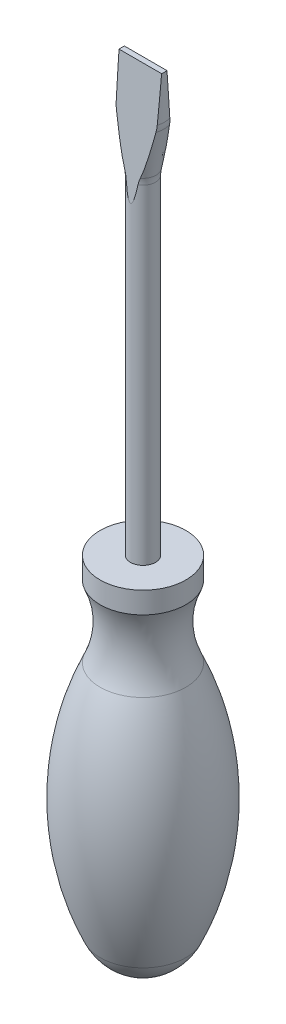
ISO-10303-21;
HEADER;
FILE_DESCRIPTION(('STEP AP214'),'2;1');
FILE_NAME('part.step','',(''),(''),'','','');
FILE_SCHEMA(('AUTOMOTIVE_DESIGN { 1 0 10303 214 1 1 1 1 }'));
ENDSEC;
DATA;
#1=APPLICATION_CONTEXT('core data for automotive mechanical design processes');
#2=APPLICATION_PROTOCOL_DEFINITION('international standard','automotive_design',2000,#1);
#3=PRODUCT_CONTEXT('',#1,'mechanical');
#4=PRODUCT('Part','Part','',(#3));
#5=PRODUCT_RELATED_PRODUCT_CATEGORY('part','',(#4));
#6=PRODUCT_DEFINITION_FORMATION('','',#4);
#7=PRODUCT_DEFINITION_CONTEXT('part definition',#1,'design');
#8=PRODUCT_DEFINITION('design','',#6,#7);
#9=PRODUCT_DEFINITION_SHAPE('','',#8);
#10=(LENGTH_UNIT() NAMED_UNIT(*) SI_UNIT(.MILLI.,.METRE.));
#11=(NAMED_UNIT(*) PLANE_ANGLE_UNIT() SI_UNIT($,.RADIAN.));
#12=(NAMED_UNIT(*) SI_UNIT($,.STERADIAN.) SOLID_ANGLE_UNIT());
#13=UNCERTAINTY_MEASURE_WITH_UNIT(LENGTH_MEASURE(1.E-05),#10,'distance_accuracy_value','');
#14=(GEOMETRIC_REPRESENTATION_CONTEXT(3) GLOBAL_UNCERTAINTY_ASSIGNED_CONTEXT((#13)) GLOBAL_UNIT_ASSIGNED_CONTEXT((#10,
#11,#12)) REPRESENTATION_CONTEXT('',''));
#15=CARTESIAN_POINT('',(0.,0.,0.));
#16=DIRECTION('',(0.,0.,1.));
#17=DIRECTION('',(1.,0.,0.));
#18=AXIS2_PLACEMENT_3D('',#15,#16,#17);
#19=CARTESIAN_POINT('',(0.,30.,0.));
#20=DIRECTION('',(0.,-1.,0.));
#21=DIRECTION('',(0.,0.,-1.));
#22=AXIS2_PLACEMENT_3D('',#19,#20,#21);
#23=CYLINDRICAL_SURFACE('',#22,3.50000000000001);
#24=CARTESIAN_POINT('',(0.,229.,0.));
#25=DIRECTION('',(0.,-0.08304547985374,0.99654575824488));
#26=DIRECTION('',(0.,-0.99654575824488,-0.08304547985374));
#27=AXIS2_PLACEMENT_3D('',#24,#25,#26);
#28=ELLIPSE('',#27,42.1455810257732,3.50000000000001);
#29=CARTESIAN_POINT('',(1.67380559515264,192.114149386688,-3.07382088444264));
#30=VERTEX_POINT('',#29);
#31=CARTESIAN_POINT('',(-1.67380559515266,192.114149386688,-3.07382088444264));
#32=VERTEX_POINT('',#31);
#33=EDGE_CURVE('E451',#30,#32,#28,.F.);
#34=ORIENTED_EDGE('',*,*,#33,.F.);
#35=CARTESIAN_POINT('',(0.,192.114149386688,0.));
#36=DIRECTION('',(0.,-1.,0.));
#37=DIRECTION('',(0.,0.,-1.));
#38=AXIS2_PLACEMENT_3D('',#35,#36,#37);
#39=CIRCLE('',#38,3.5);
#40=CARTESIAN_POINT('',(1.67380559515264,192.114149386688,3.07382088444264));
#41=VERTEX_POINT('',#40);
#42=EDGE_CURVE('E242',#30,#41,#39,.T.);
#43=ORIENTED_EDGE('',*,*,#42,.T.);
#44=CARTESIAN_POINT('',(0.,229.,0.));
#45=DIRECTION('',(0.,0.08304547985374,0.99654575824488));
#46=DIRECTION('',(0.,-0.99654575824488,0.08304547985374));
#47=AXIS2_PLACEMENT_3D('',#44,#45,#46);
#48=ELLIPSE('',#47,42.1455810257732,3.50000000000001);
#49=CARTESIAN_POINT('',(-1.67380559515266,192.114149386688,3.07382088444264));
#50=VERTEX_POINT('',#49);
#51=EDGE_CURVE('E480',#41,#50,#48,.F.);
#52=ORIENTED_EDGE('',*,*,#51,.T.);
#53=EDGE_CURVE('E241',#50,#32,#39,.T.);
#54=ORIENTED_EDGE('',*,*,#53,.T.);
#55=EDGE_LOOP('',(#34,#43,#52,#54));
#56=FACE_BOUND('',#55,.T.);
#57=CARTESIAN_POINT('',(0.,30.,0.));
#58=DIRECTION('',(0.,-1.,0.));
#59=DIRECTION('',(0.,0.,-1.));
#60=AXIS2_PLACEMENT_3D('',#57,#58,#59);
#61=CIRCLE('',#60,3.50000000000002);
#62=CARTESIAN_POINT('',(0.,30.,-3.50000000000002));
#63=VERTEX_POINT('',#62);
#64=EDGE_CURVE('E245',#63,#63,#61,.T.);
#65=ORIENTED_EDGE('',*,*,#64,.F.);
#66=EDGE_LOOP('',(#65));
#67=FACE_BOUND('',#66,.T.);
#68=CARTESIAN_POINT('',(0.,80.,0.));
#69=DIRECTION('',(0.,-1.,0.));
#70=DIRECTION('',(0.,0.,-1.));
#71=AXIS2_PLACEMENT_3D('',#68,#69,#70);
#72=CIRCLE('',#71,3.50000000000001);
#73=CARTESIAN_POINT('',(-3.16227766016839,80.,-1.5));
#74=VERTEX_POINT('',#73);
#75=CARTESIAN_POINT('',(-3.50000000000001,80.,0.));
#76=VERTEX_POINT('',#75);
#77=EDGE_CURVE('E255',#74,#76,#72,.F.);
#78=ORIENTED_EDGE('',*,*,#77,.T.);
#79=CARTESIAN_POINT('',(-3.16227766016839,80.,1.5));
#80=VERTEX_POINT('',#79);
#81=EDGE_CURVE('E259',#76,#80,#72,.F.);
#82=ORIENTED_EDGE('',*,*,#81,.T.);
#83=DIRECTION('',(0.,-1.,0.));
#84=VECTOR('',#83,1.);
#85=CARTESIAN_POINT('',(-3.16227766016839,30.,1.5));
#86=LINE('',#85,#84);
#87=CARTESIAN_POINT('',(-3.16227766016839,60.,1.5));
#88=VERTEX_POINT('',#87);
#89=EDGE_CURVE('E257',#80,#88,#86,.T.);
#90=ORIENTED_EDGE('',*,*,#89,.T.);
#91=CARTESIAN_POINT('',(0.,60.,0.));
#92=DIRECTION('',(0.,1.,0.));
#93=DIRECTION('',(0.,0.,1.));
#94=AXIS2_PLACEMENT_3D('',#91,#92,#93);
#95=CIRCLE('',#94,3.50000000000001);
#96=CARTESIAN_POINT('',(-3.50000000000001,60.,0.));
#97=VERTEX_POINT('',#96);
#98=EDGE_CURVE('E253',#88,#97,#95,.F.);
#99=ORIENTED_EDGE('',*,*,#98,.T.);
#100=CARTESIAN_POINT('',(-3.16227766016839,60.,-1.5));
#101=VERTEX_POINT('',#100);
#102=EDGE_CURVE('E251',#97,#101,#95,.F.);
#103=ORIENTED_EDGE('',*,*,#102,.T.);
#104=DIRECTION('',(0.,-1.,0.));
#105=VECTOR('',#104,1.);
#106=CARTESIAN_POINT('',(-3.16227766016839,30.,-1.5));
#107=LINE('',#106,#105);
#108=EDGE_CURVE('E248',#74,#101,#107,.T.);
#109=ORIENTED_EDGE('',*,*,#108,.F.);
#110=EDGE_LOOP('',(#78,#82,#90,#99,#103,#109));
#111=FACE_BOUND('',#110,.T.);
#112=CARTESIAN_POINT('',(3.16227766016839,60.,-1.5));
#113=VERTEX_POINT('',#112);
#114=CARTESIAN_POINT('',(3.50000000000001,60.,0.));
#115=VERTEX_POINT('',#114);
#116=EDGE_CURVE('E264',#113,#115,#95,.F.);
#117=ORIENTED_EDGE('',*,*,#116,.T.);
#118=CARTESIAN_POINT('',(3.16227766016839,60.,1.5));
#119=VERTEX_POINT('',#118);
#120=EDGE_CURVE('E254',#115,#119,#95,.F.);
#121=ORIENTED_EDGE('',*,*,#120,.T.);
#122=DIRECTION('',(0.,-1.,0.));
#123=VECTOR('',#122,1.);
#124=CARTESIAN_POINT('',(3.16227766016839,30.,1.5));
#125=LINE('',#124,#123);
#126=CARTESIAN_POINT('',(3.16227766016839,80.,1.5));
#127=VERTEX_POINT('',#126);
#128=EDGE_CURVE('E265',#119,#127,#125,.F.);
#129=ORIENTED_EDGE('',*,*,#128,.T.);
#130=CARTESIAN_POINT('',(3.50000000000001,80.,0.));
#131=VERTEX_POINT('',#130);
#132=EDGE_CURVE('E258',#127,#131,#72,.F.);
#133=ORIENTED_EDGE('',*,*,#132,.T.);
#134=CARTESIAN_POINT('',(3.16227766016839,80.,-1.5));
#135=VERTEX_POINT('',#134);
#136=EDGE_CURVE('E271',#131,#135,#72,.F.);
#137=ORIENTED_EDGE('',*,*,#136,.T.);
#138=DIRECTION('',(0.,-1.,0.));
#139=VECTOR('',#138,1.);
#140=CARTESIAN_POINT('',(3.16227766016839,30.,-1.5));
#141=LINE('',#140,#139);
#142=EDGE_CURVE('E261',#113,#135,#141,.F.);
#143=ORIENTED_EDGE('',*,*,#142,.F.);
#144=EDGE_LOOP('',(#117,#121,#129,#133,#137,#143));
#145=FACE_BOUND('',#144,.T.);
#146=ADVANCED_FACE('F45',(#56,#67,#111,#145),#23,.T.);
#147=CARTESIAN_POINT('',(0.,220.,0.));
#148=DIRECTION('',(0.,1.,0.));
#149=DIRECTION('',(0.,0.,1.));
#150=AXIS2_PLACEMENT_3D('',#147,#148,#149);
#151=PLANE('',#150);
#152=DIRECTION('',(1.,0.,0.));
#153=VECTOR('',#152,1.);
#154=CARTESIAN_POINT('',(-10.,220.,-0.750000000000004));
#155=LINE('',#154,#153);
#156=CARTESIAN_POINT('',(-5.95294044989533,220.,-0.750000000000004));
#157=VERTEX_POINT('',#156);
#158=CARTESIAN_POINT('',(5.95294044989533,220.,-0.750000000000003));
#159=VERTEX_POINT('',#158);
#160=EDGE_CURVE('E67',#157,#159,#155,.T.);
#161=ORIENTED_EDGE('',*,*,#160,.F.);
#162=CARTESIAN_POINT('',(0.,220.,0.));
#163=DIRECTION('',(0.,-1.,0.));
#164=DIRECTION('',(0.,0.,-1.));
#165=AXIS2_PLACEMENT_3D('',#162,#163,#164);
#166=CIRCLE('',#165,6.);
#167=CARTESIAN_POINT('',(-5.95294044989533,220.,0.75));
#168=VERTEX_POINT('',#167);
#169=EDGE_CURVE('E219',#168,#157,#166,.T.);
#170=ORIENTED_EDGE('',*,*,#169,.F.);
#171=DIRECTION('',(1.,0.,0.));
#172=VECTOR('',#171,1.);
#173=CARTESIAN_POINT('',(-10.,220.,0.75));
#174=LINE('',#173,#172);
#175=CARTESIAN_POINT('',(5.95294044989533,220.,0.75));
#176=VERTEX_POINT('',#175);
#177=EDGE_CURVE('E203',#168,#176,#174,.T.);
#178=ORIENTED_EDGE('',*,*,#177,.T.);
#179=EDGE_CURVE('E222',#159,#176,#166,.T.);
#180=ORIENTED_EDGE('',*,*,#179,.F.);
#181=EDGE_LOOP('',(#161,#170,#178,#180));
#182=FACE_BOUND('',#181,.T.);
#183=ADVANCED_FACE('F47',(#182),#151,.T.);
#184=CARTESIAN_POINT('',(0.,192.114149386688,0.));
#185=DIRECTION('',(0.,-1.,0.));
#186=DIRECTION('',(0.,0.,-1.));
#187=AXIS2_PLACEMENT_3D('',#184,#185,#186);
#188=TOROIDAL_SURFACE('',#187,13.5,10.);
#189=CARTESIAN_POINT('',(2.18984593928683,193.872255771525,-2.92731201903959));
#190=CARTESIAN_POINT('',(2.1318202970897,193.730376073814,-2.93913532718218));
#191=CARTESIAN_POINT('',(2.07647996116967,193.587339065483,-2.95105507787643));
#192=CARTESIAN_POINT('',(1.97285246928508,193.299310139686,-2.9750574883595));
#193=CARTESIAN_POINT('',(1.92454200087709,193.154326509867,-2.98713945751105));
#194=CARTESIAN_POINT('',(1.83622992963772,192.861760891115,-3.01151992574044));
#195=CARTESIAN_POINT('',(1.79623067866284,192.71417817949,-3.02381848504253));
#196=CARTESIAN_POINT('',(1.72659898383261,192.416097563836,-3.048658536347));
#197=CARTESIAN_POINT('',(1.69700236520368,192.26559143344,-3.06120071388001));
#198=CARTESIAN_POINT('',(1.67377499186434,192.113949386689,-3.07383755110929));
#199=B_SPLINE_CURVE_WITH_KNOTS('',3,(#189,#190,#191,#192,#193,#194,#195,#196,#197,#198),
.UNSPECIFIED.,.F.,.F.,(4,2,2,2,4),(0.,0.461285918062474,0.92100544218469,1.38085487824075,
1.84227280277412),.UNSPECIFIED.);
#200=CARTESIAN_POINT('',(2.18976403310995,193.872055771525,-2.92732868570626));
#201=VERTEX_POINT('',#200);
#202=EDGE_CURVE('E439',#201,#30,#199,.T.);
#203=ORIENTED_EDGE('',*,*,#202,.F.);
#204=CARTESIAN_POINT('',(0.,193.872055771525,0.));
#205=DIRECTION('',(0.,-1.,0.));
#206=DIRECTION('',(0.,0.,-1.));
#207=AXIS2_PLACEMENT_3D('',#204,#205,#206);
#208=CIRCLE('',#207,3.65572424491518);
#209=CARTESIAN_POINT('',(2.18976403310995,193.872055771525,2.92732868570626));
#210=VERTEX_POINT('',#209);
#211=EDGE_CURVE('E238',#201,#210,#208,.T.);
#212=ORIENTED_EDGE('',*,*,#211,.T.);
#213=CARTESIAN_POINT('',(2.18984593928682,193.872255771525,2.92731201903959));
#214=CARTESIAN_POINT('',(2.1318202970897,193.730376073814,2.93913532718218));
#215=CARTESIAN_POINT('',(2.07647996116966,193.587339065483,2.95105507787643));
#216=CARTESIAN_POINT('',(1.97285246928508,193.299310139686,2.9750574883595));
#217=CARTESIAN_POINT('',(1.92454200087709,193.154326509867,2.98713945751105));
#218=CARTESIAN_POINT('',(1.83622992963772,192.861760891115,3.01151992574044));
#219=CARTESIAN_POINT('',(1.79623067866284,192.71417817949,3.02381848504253));
#220=CARTESIAN_POINT('',(1.72659898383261,192.416097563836,3.048658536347));
#221=CARTESIAN_POINT('',(1.69700236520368,192.26559143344,3.06120071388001));
#222=CARTESIAN_POINT('',(1.67377499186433,192.113949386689,3.07383755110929));
#223=B_SPLINE_CURVE_WITH_KNOTS('',3,(#213,#214,#215,#216,#217,#218,#219,#220,#221,#222),
.UNSPECIFIED.,.F.,.F.,(4,2,2,2,4),(0.,0.461285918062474,0.92100544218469,1.38085487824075,
1.84227280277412),.UNSPECIFIED.);
#224=EDGE_CURVE('E463',#210,#41,#223,.T.);
#225=ORIENTED_EDGE('',*,*,#224,.T.);
#226=ORIENTED_EDGE('',*,*,#42,.F.);
#227=EDGE_LOOP('',(#203,#212,#225,#226));
#228=FACE_BOUND('',#227,.T.);
#229=ADVANCED_FACE('F452',(#228),#188,.F.);
#230=CARTESIAN_POINT('',(-1.6737749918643,192.113949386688,-3.0738375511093));
#231=CARTESIAN_POINT('',(-1.69700236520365,192.26559143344,-3.06120071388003));
#232=CARTESIAN_POINT('',(-1.72659898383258,192.416097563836,-3.04865853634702));
#233=CARTESIAN_POINT('',(-1.79623067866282,192.71417817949,-3.02381848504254));
#234=CARTESIAN_POINT('',(-1.8362299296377,192.861760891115,-3.01151992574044));
#235=CARTESIAN_POINT('',(-1.92454200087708,193.154326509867,-2.98713945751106));
#236=CARTESIAN_POINT('',(-1.97285246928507,193.299310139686,-2.9750574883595));
#237=CARTESIAN_POINT('',(-2.07647996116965,193.587339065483,-2.95105507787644));
#238=CARTESIAN_POINT('',(-2.13182029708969,193.730376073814,-2.93913532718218));
#239=CARTESIAN_POINT('',(-2.18984593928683,193.872255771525,-2.92731201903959));
#240=B_SPLINE_CURVE_WITH_KNOTS('',3,(#230,#231,#232,#233,#234,#235,#236,#237,#238,#239),
.UNSPECIFIED.,.F.,.F.,(4,2,2,2,4),(0.,0.461417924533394,0.921267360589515,1.38098688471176,
1.84227280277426),.UNSPECIFIED.);
#241=CARTESIAN_POINT('',(-2.18976403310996,193.872055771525,-2.92732868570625));
#242=VERTEX_POINT('',#241);
#243=EDGE_CURVE('E446',#32,#242,#240,.T.);
#244=ORIENTED_EDGE('',*,*,#243,.F.);
#245=ORIENTED_EDGE('',*,*,#53,.F.);
#246=CARTESIAN_POINT('',(-1.67377499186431,192.113949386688,3.0738375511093));
#247=CARTESIAN_POINT('',(-1.69700236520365,192.26559143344,3.06120071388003));
#248=CARTESIAN_POINT('',(-1.72659898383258,192.416097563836,3.04865853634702));
#249=CARTESIAN_POINT('',(-1.79623067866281,192.71417817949,3.02381848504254));
#250=CARTESIAN_POINT('',(-1.83622992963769,192.861760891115,3.01151992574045));
#251=CARTESIAN_POINT('',(-1.92454200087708,193.154326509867,2.98713945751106));
#252=CARTESIAN_POINT('',(-1.97285246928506,193.299310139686,2.9750574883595));
#253=CARTESIAN_POINT('',(-2.07647996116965,193.587339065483,2.95105507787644));
#254=CARTESIAN_POINT('',(-2.1318202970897,193.730376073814,2.93913532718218));
#255=CARTESIAN_POINT('',(-2.18984593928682,193.872255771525,2.92731201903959));
#256=B_SPLINE_CURVE_WITH_KNOTS('',3,(#246,#247,#248,#249,#250,#251,#252,#253,#254,#255),
.UNSPECIFIED.,.F.,.F.,(4,2,2,2,4),(0.,0.461417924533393,0.921267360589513,1.38098688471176,
1.84227280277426),.UNSPECIFIED.);
#257=CARTESIAN_POINT('',(-2.18976403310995,193.872055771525,2.92732868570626));
#258=VERTEX_POINT('',#257);
#259=EDGE_CURVE('E472',#50,#258,#256,.T.);
#260=ORIENTED_EDGE('',*,*,#259,.T.);
#261=EDGE_CURVE('E237',#258,#242,#208,.T.);
#262=ORIENTED_EDGE('',*,*,#261,.T.);
#263=EDGE_LOOP('',(#244,#245,#260,#262));
#264=FACE_BOUND('',#263,.T.);
#265=ADVANCED_FACE('F456',(#264),#188,.F.);
#266=CARTESIAN_POINT('',(0.,193.872055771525,0.));
#267=DIRECTION('',(0.,1.,0.));
#268=DIRECTION('',(0.,0.,1.));
#269=AXIS2_PLACEMENT_3D('',#266,#267,#268);
#270=CONICAL_SURFACE('',#269,3.65572424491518,0.176708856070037);
#271=CARTESIAN_POINT('',(5.52477930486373,206.128144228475,-1.90598798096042));
#272=CARTESIAN_POINT('',(5.43678863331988,205.723928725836,-1.93967260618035));
#273=CARTESIAN_POINT('',(5.34787259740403,205.319911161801,-1.97334073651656));
#274=CARTESIAN_POINT('',(5.16783715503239,204.512354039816,-2.04063716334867));
#275=CARTESIAN_POINT('',(5.07671769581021,204.108814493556,-2.07426545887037));
#276=CARTESIAN_POINT('',(4.89185553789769,203.302003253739,-2.14149972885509));
#277=CARTESIAN_POINT('',(4.79811086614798,202.898732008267,-2.17510566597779));
#278=CARTESIAN_POINT('',(4.60759624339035,202.092901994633,-2.24225816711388));
#279=CARTESIAN_POINT('',(4.51082631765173,201.690343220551,-2.27580473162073));
#280=CARTESIAN_POINT('',(4.31400742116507,200.887545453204,-2.34270454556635));
#281=CARTESIAN_POINT('',(4.21397141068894,200.487303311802,-2.37605805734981));
#282=CARTESIAN_POINT('',(4.00949441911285,199.6879380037,-2.44267183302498));
#283=CARTESIAN_POINT('',(3.90505348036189,199.288814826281,-2.4759320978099));
#284=CARTESIAN_POINT('',(3.69068745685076,198.492148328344,-2.54232097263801));
#285=CARTESIAN_POINT('',(3.58076390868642,198.094604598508,-2.57544961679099));
#286=CARTESIAN_POINT('',(3.35383271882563,197.301525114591,-2.6415395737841));
#287=CARTESIAN_POINT('',(3.23682530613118,196.905989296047,-2.67450089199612));
#288=CARTESIAN_POINT('',(3.04622907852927,196.289242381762,-2.72589646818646));
#289=CARTESIAN_POINT('',(2.97589030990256,196.06703485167,-2.7444137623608));
#290=CARTESIAN_POINT('',(2.8315026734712,195.623823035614,-2.78134808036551));
#291=CARTESIAN_POINT('',(2.75745391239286,195.402818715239,-2.79976510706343));
#292=CARTESIAN_POINT('',(2.60470377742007,194.962177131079,-2.83648523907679));
#293=CARTESIAN_POINT('',(2.52599826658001,194.742541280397,-2.85478822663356));
#294=CARTESIAN_POINT('',(2.40353638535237,194.414687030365,-2.88210941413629));
#295=CARTESIAN_POINT('',(2.36197581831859,194.305654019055,-2.89119549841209));
#296=CARTESIAN_POINT('',(2.27715808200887,194.088237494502,-2.90931354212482));
#297=CARTESIAN_POINT('',(2.23390079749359,193.979854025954,-2.91834549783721));
#298=CARTESIAN_POINT('',(2.18968212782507,193.871855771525,-2.92734535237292));
#299=B_SPLINE_CURVE_WITH_KNOTS('',3,(#271,#272,#273,#274,#275,#276,#277,#278,#279,#280,#281,
#282,#283,#284,#285,#286,#287,#288,#289,#290,#291,#292,#293,#294,#295,#296,#297,#298),
.UNSPECIFIED.,.F.,.F.,(4,2,2,2,2,2,2,2,2,2,2,2,2,4),(0.,1.24515446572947,2.49033877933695,
3.73648549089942,4.98262179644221,6.22430288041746,7.46597202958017,8.70729511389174,
9.94857809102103,10.6499793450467,11.3513604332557,12.0533742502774,12.4044775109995,
12.7556046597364),.UNSPECIFIED.);
#300=CARTESIAN_POINT('',(5.5247357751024,206.127944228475,-1.90600464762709));
#301=VERTEX_POINT('',#300);
#302=EDGE_CURVE('E432',#301,#201,#299,.T.);
#303=ORIENTED_EDGE('',*,*,#302,.F.);
#304=CARTESIAN_POINT('',(0.,206.127944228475,0.));
#305=DIRECTION('',(0.,-1.,0.));
#306=DIRECTION('',(0.,0.,-1.));
#307=AXIS2_PLACEMENT_3D('',#304,#305,#306);
#308=CIRCLE('',#307,5.84427575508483);
#309=CARTESIAN_POINT('',(5.5247357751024,206.127944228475,1.90600464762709));
#310=VERTEX_POINT('',#309);
#311=EDGE_CURVE('E234',#301,#310,#308,.T.);
#312=ORIENTED_EDGE('',*,*,#311,.T.);
#313=CARTESIAN_POINT('',(5.52477930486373,206.128144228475,1.90598798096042));
#314=CARTESIAN_POINT('',(5.43678863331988,205.723928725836,1.93967260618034));
#315=CARTESIAN_POINT('',(5.34787259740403,205.319911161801,1.97334073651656));
#316=CARTESIAN_POINT('',(5.16783715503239,204.512354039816,2.04063716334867));
#317=CARTESIAN_POINT('',(5.07671769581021,204.108814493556,2.07426545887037));
#318=CARTESIAN_POINT('',(4.89185553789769,203.302003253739,2.14149972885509));
#319=CARTESIAN_POINT('',(4.79811086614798,202.898732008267,2.17510566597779));
#320=CARTESIAN_POINT('',(4.60759624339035,202.092901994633,2.24225816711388));
#321=CARTESIAN_POINT('',(4.51082631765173,201.690343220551,2.27580473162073));
#322=CARTESIAN_POINT('',(4.31400742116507,200.887545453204,2.34270454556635));
#323=CARTESIAN_POINT('',(4.21397141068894,200.487303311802,2.37605805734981));
#324=CARTESIAN_POINT('',(4.00949441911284,199.6879380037,2.44267183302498));
#325=CARTESIAN_POINT('',(3.90505348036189,199.288814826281,2.4759320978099));
#326=CARTESIAN_POINT('',(3.69068745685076,198.492148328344,2.542320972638));
#327=CARTESIAN_POINT('',(3.58076390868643,198.094604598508,2.57544961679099));
#328=CARTESIAN_POINT('',(3.35383271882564,197.301525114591,2.6415395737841));
#329=CARTESIAN_POINT('',(3.23682530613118,196.905989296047,2.67450089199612));
#330=CARTESIAN_POINT('',(3.04622907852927,196.289242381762,2.72589646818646));
#331=CARTESIAN_POINT('',(2.97589030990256,196.06703485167,2.7444137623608));
#332=CARTESIAN_POINT('',(2.8315026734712,195.623823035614,2.78134808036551));
#333=CARTESIAN_POINT('',(2.75745391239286,195.402818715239,2.79976510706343));
#334=CARTESIAN_POINT('',(2.60470377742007,194.962177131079,2.83648523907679));
#335=CARTESIAN_POINT('',(2.52599826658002,194.742541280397,2.85478822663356));
#336=CARTESIAN_POINT('',(2.40353638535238,194.414687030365,2.88210941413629));
#337=CARTESIAN_POINT('',(2.36197581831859,194.305654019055,2.89119549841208));
#338=CARTESIAN_POINT('',(2.27715808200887,194.088237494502,2.90931354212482));
#339=CARTESIAN_POINT('',(2.23390079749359,193.979854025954,2.91834549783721));
#340=CARTESIAN_POINT('',(2.18968212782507,193.871855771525,2.92734535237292));
#341=B_SPLINE_CURVE_WITH_KNOTS('',3,(#313,#314,#315,#316,#317,#318,#319,#320,#321,#322,#323,
#324,#325,#326,#327,#328,#329,#330,#331,#332,#333,#334,#335,#336,#337,#338,#339,#340),
.UNSPECIFIED.,.F.,.F.,(4,2,2,2,2,2,2,2,2,2,2,2,2,4),(0.,1.24515446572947,2.49033877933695,
3.73648549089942,4.98262179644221,6.22430288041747,7.46597202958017,8.70729511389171,
9.94857809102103,10.6499793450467,11.3513604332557,12.0533742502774,12.4044775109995,
12.7556046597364),.UNSPECIFIED.);
#342=EDGE_CURVE('E768',#310,#210,#341,.T.);
#343=ORIENTED_EDGE('',*,*,#342,.T.);
#344=ORIENTED_EDGE('',*,*,#211,.F.);
#345=EDGE_LOOP('',(#303,#312,#343,#344));
#346=FACE_BOUND('',#345,.T.);
#347=ADVANCED_FACE('F458',(#346),#270,.T.);
#348=CARTESIAN_POINT('',(-2.18968212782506,193.871855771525,-2.92734535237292));
#349=CARTESIAN_POINT('',(-2.2389104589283,193.992104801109,-2.91732459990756));
#350=CARTESIAN_POINT('',(-2.28695480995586,194.11282816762,-2.90726431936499));
#351=CARTESIAN_POINT('',(-2.38097166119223,194.355063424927,-2.88707804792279));
#352=CARTESIAN_POINT('',(-2.42694432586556,194.47657525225,-2.87695206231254));
#353=CARTESIAN_POINT('',(-2.51710834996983,194.720210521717,-2.85664912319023));
#354=CARTESIAN_POINT('',(-2.5613002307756,194.842333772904,-2.84647218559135));
#355=CARTESIAN_POINT('',(-2.6481386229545,195.087126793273,-2.82607276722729));
#356=CARTESIAN_POINT('',(-2.69078509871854,195.209796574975,-2.81585028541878));
#357=CARTESIAN_POINT('',(-2.81662593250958,195.578298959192,-2.78514175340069));
#358=CARTESIAN_POINT('',(-2.89779317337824,195.824819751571,-2.76459835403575));
#359=CARTESIAN_POINT('',(-3.0558436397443,196.319236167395,-2.72339698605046));
#360=CARTESIAN_POINT('',(-3.13272648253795,196.567131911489,-2.70273900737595));
#361=CARTESIAN_POINT('',(-3.28288539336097,197.063629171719,-2.66136423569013));
#362=CARTESIAN_POINT('',(-3.35616630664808,197.312229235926,-2.64064756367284));
#363=CARTESIAN_POINT('',(-3.49981367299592,197.810252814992,-2.59914559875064));
#364=CARTESIAN_POINT('',(-3.57018021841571,198.059676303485,-2.57836030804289));
#365=CARTESIAN_POINT('',(-3.77763910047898,198.809071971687,-2.51591066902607));
#366=CARTESIAN_POINT('',(-3.91105650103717,199.310054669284,-2.474162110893));
#367=CARTESIAN_POINT('',(-4.17612587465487,200.335162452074,-2.38873646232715));
#368=CARTESIAN_POINT('',(-4.30746287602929,200.859367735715,-2.3450526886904));
#369=CARTESIAN_POINT('',(-4.56404600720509,201.909200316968,-2.25756664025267));
#370=CARTESIAN_POINT('',(-4.68929270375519,202.43482747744,-2.21376437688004));
#371=CARTESIAN_POINT('',(-4.93514910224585,203.487890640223,-2.12600911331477));
#372=CARTESIAN_POINT('',(-5.055752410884,204.015328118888,-2.08205599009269));
#373=CARTESIAN_POINT('',(-5.29301258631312,205.071115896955,-1.99407367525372));
#374=CARTESIAN_POINT('',(-5.40966923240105,205.599466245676,-1.95004447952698));
#375=CARTESIAN_POINT('',(-5.52477930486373,206.128144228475,-1.90598798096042));
#376=B_SPLINE_CURVE_WITH_KNOTS('',3,(#348,#349,#350,#351,#352,#353,#354,#355,#356,#357,#358,
#359,#360,#361,#362,#363,#364,#365,#366,#367,#368,#369,#370,#371,#372,#373,#374,#375),
.UNSPECIFIED.,.F.,.F.,(4,2,2,2,2,2,2,2,2,2,2,2,2,4),(0.,0.39094853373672,0.781865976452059,
1.17266812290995,1.5634792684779,2.34447631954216,3.12554302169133,3.90552855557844,
4.68548935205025,6.24577102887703,7.87224026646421,9.49855785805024,11.1270399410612,
12.7556129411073),.UNSPECIFIED.);
#377=CARTESIAN_POINT('',(-5.5247357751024,206.127944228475,-1.90600464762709));
#378=VERTEX_POINT('',#377);
#379=EDGE_CURVE('E404',#242,#378,#376,.T.);
#380=ORIENTED_EDGE('',*,*,#379,.F.);
#381=ORIENTED_EDGE('',*,*,#261,.F.);
#382=CARTESIAN_POINT('',(-2.18968212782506,193.871855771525,2.92734535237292));
#383=CARTESIAN_POINT('',(-2.2389104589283,193.992104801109,2.91732459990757));
#384=CARTESIAN_POINT('',(-2.28695480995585,194.11282816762,2.90726431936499));
#385=CARTESIAN_POINT('',(-2.38097166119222,194.355063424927,2.88707804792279));
#386=CARTESIAN_POINT('',(-2.42694432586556,194.47657525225,2.87695206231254));
#387=CARTESIAN_POINT('',(-2.51710834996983,194.720210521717,2.85664912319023));
#388=CARTESIAN_POINT('',(-2.5613002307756,194.842333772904,2.84647218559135));
#389=CARTESIAN_POINT('',(-2.6481386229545,195.087126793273,2.82607276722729));
#390=CARTESIAN_POINT('',(-2.69078509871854,195.209796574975,2.81585028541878));
#391=CARTESIAN_POINT('',(-2.81662593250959,195.578298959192,2.78514175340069));
#392=CARTESIAN_POINT('',(-2.89779317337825,195.824819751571,2.76459835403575));
#393=CARTESIAN_POINT('',(-3.05584363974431,196.319236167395,2.72339698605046));
#394=CARTESIAN_POINT('',(-3.13272648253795,196.567131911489,2.70273900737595));
#395=CARTESIAN_POINT('',(-3.28288539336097,197.063629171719,2.66136423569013));
#396=CARTESIAN_POINT('',(-3.35616630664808,197.312229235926,2.64064756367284));
#397=CARTESIAN_POINT('',(-3.49981367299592,197.810252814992,2.59914559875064));
#398=CARTESIAN_POINT('',(-3.57018021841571,198.059676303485,2.57836030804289));
#399=CARTESIAN_POINT('',(-3.77763910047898,198.809071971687,2.51591066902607));
#400=CARTESIAN_POINT('',(-3.91105650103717,199.310054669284,2.474162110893));
#401=CARTESIAN_POINT('',(-4.17612587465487,200.335162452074,2.38873646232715));
#402=CARTESIAN_POINT('',(-4.30746287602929,200.859367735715,2.34505268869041));
#403=CARTESIAN_POINT('',(-4.56404600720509,201.909200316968,2.25756664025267));
#404=CARTESIAN_POINT('',(-4.68929270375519,202.43482747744,2.21376437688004));
#405=CARTESIAN_POINT('',(-4.93514910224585,203.487890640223,2.12600911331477));
#406=CARTESIAN_POINT('',(-5.055752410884,204.015328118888,2.08205599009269));
#407=CARTESIAN_POINT('',(-5.29301258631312,205.071115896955,1.99407367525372));
#408=CARTESIAN_POINT('',(-5.40966923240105,205.599466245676,1.95004447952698));
#409=CARTESIAN_POINT('',(-5.52477930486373,206.128144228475,1.90598798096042));
#410=B_SPLINE_CURVE_WITH_KNOTS('',3,(#382,#383,#384,#385,#386,#387,#388,#389,#390,#391,#392,
#393,#394,#395,#396,#397,#398,#399,#400,#401,#402,#403,#404,#405,#406,#407,#408,#409),
.UNSPECIFIED.,.F.,.F.,(4,2,2,2,2,2,2,2,2,2,2,2,2,4),(0.,0.39094853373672,0.78186597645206,
1.17266812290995,1.5634792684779,2.34447631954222,3.12554302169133,3.90552855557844,
4.68548935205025,6.24577102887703,7.87224026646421,9.49855785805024,11.1270399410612,
12.7556129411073),.UNSPECIFIED.);
#411=CARTESIAN_POINT('',(-5.5247357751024,206.127944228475,1.90600464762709));
#412=VERTEX_POINT('',#411);
#413=EDGE_CURVE('E479',#258,#412,#410,.T.);
#414=ORIENTED_EDGE('',*,*,#413,.T.);
#415=EDGE_CURVE('E233',#412,#378,#308,.T.);
#416=ORIENTED_EDGE('',*,*,#415,.T.);
#417=EDGE_LOOP('',(#380,#381,#414,#416));
#418=FACE_BOUND('',#417,.T.);
#419=ADVANCED_FACE('F510',(#418),#270,.T.);
#420=CARTESIAN_POINT('',(0.,207.885850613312,0.));
#421=DIRECTION('',(0.,-1.,0.));
#422=DIRECTION('',(0.,0.,-1.));
#423=AXIS2_PLACEMENT_3D('',#420,#421,#422);
#424=DEGENERATE_TOROIDAL_SURFACE('',#423,4.,10.,.F.);
#425=CARTESIAN_POINT('',(5.73621604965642,207.886050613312,-1.75949578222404));
#426=CARTESIAN_POINT('',(5.72868223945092,207.590471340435,-1.78412738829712));
#427=CARTESIAN_POINT('',(5.70724503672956,207.295357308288,-1.80872022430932));
#428=CARTESIAN_POINT('',(5.65435603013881,206.85534805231,-1.84538766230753));
#429=CARTESIAN_POINT('',(5.6332838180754,206.70918181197,-1.85756818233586));
#430=CARTESIAN_POINT('',(5.58419851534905,206.417679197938,-1.88186006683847));
#431=CARTESIAN_POINT('',(5.55617017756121,206.27234537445,-1.89397121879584));
#432=CARTESIAN_POINT('',(5.524692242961,206.127744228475,-1.90602131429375));
#433=B_SPLINE_CURVE_WITH_KNOTS('',3,(#425,#426,#427,#428,#429,#430,#431,#432),.UNSPECIFIED.,.F.,
.F.,(4,2,2,4),(0.,0.889500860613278,1.33388400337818,1.77924992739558),.UNSPECIFIED.);
#434=CARTESIAN_POINT('',(5.73621093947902,207.885850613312,-1.75951244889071));
#435=VERTEX_POINT('',#434);
#436=EDGE_CURVE('E423',#435,#301,#433,.T.);
#437=ORIENTED_EDGE('',*,*,#436,.F.);
#438=CARTESIAN_POINT('',(0.,207.885850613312,0.));
#439=DIRECTION('',(0.,-1.,0.));
#440=DIRECTION('',(0.,0.,-1.));
#441=AXIS2_PLACEMENT_3D('',#438,#439,#440);
#442=CIRCLE('',#441,6.00000000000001);
#443=CARTESIAN_POINT('',(5.73621093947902,207.885850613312,1.75951244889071));
#444=VERTEX_POINT('',#443);
#445=EDGE_CURVE('E230',#435,#444,#442,.T.);
#446=ORIENTED_EDGE('',*,*,#445,.T.);
#447=CARTESIAN_POINT('',(5.73621604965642,207.886050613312,1.75949578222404));
#448=CARTESIAN_POINT('',(5.72868223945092,207.590471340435,1.78412738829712));
#449=CARTESIAN_POINT('',(5.70724503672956,207.295357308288,1.80872022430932));
#450=CARTESIAN_POINT('',(5.65435603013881,206.85534805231,1.84538766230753));
#451=CARTESIAN_POINT('',(5.6332838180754,206.70918181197,1.85756818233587));
#452=CARTESIAN_POINT('',(5.58419851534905,206.417679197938,1.88186006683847));
#453=CARTESIAN_POINT('',(5.55617017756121,206.27234537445,1.89397121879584));
#454=CARTESIAN_POINT('',(5.524692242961,206.127744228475,1.90602131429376));
#455=B_SPLINE_CURVE_WITH_KNOTS('',3,(#447,#448,#449,#450,#451,#452,#453,#454),.UNSPECIFIED.,.F.,
.F.,(4,2,2,4),(0.,0.889500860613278,1.33388400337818,1.77924992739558),.UNSPECIFIED.);
#456=EDGE_CURVE('E60',#444,#310,#455,.T.);
#457=ORIENTED_EDGE('',*,*,#456,.T.);
#458=ORIENTED_EDGE('',*,*,#311,.F.);
#459=EDGE_LOOP('',(#437,#446,#457,#458));
#460=FACE_BOUND('',#459,.T.);
#461=ADVANCED_FACE('F411',(#460),#424,.F.);
#462=CARTESIAN_POINT('',(-5.524692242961,206.127744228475,-1.90602131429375));
#463=CARTESIAN_POINT('',(-5.55617017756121,206.27234537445,-1.89397121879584));
#464=CARTESIAN_POINT('',(-5.58419851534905,206.417679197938,-1.88186006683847));
#465=CARTESIAN_POINT('',(-5.6332838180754,206.70918181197,-1.85756818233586));
#466=CARTESIAN_POINT('',(-5.65435603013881,206.85534805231,-1.84538766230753));
#467=CARTESIAN_POINT('',(-5.70724503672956,207.295357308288,-1.80872022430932));
#468=CARTESIAN_POINT('',(-5.72868223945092,207.590471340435,-1.78412738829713));
#469=CARTESIAN_POINT('',(-5.73621604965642,207.886050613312,-1.75949578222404));
#470=B_SPLINE_CURVE_WITH_KNOTS('',3,(#462,#463,#464,#465,#466,#467,#468,#469),.UNSPECIFIED.,.F.,
.F.,(4,2,2,4),(0.,0.445365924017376,0.889749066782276,1.77924992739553),.UNSPECIFIED.);
#471=CARTESIAN_POINT('',(-5.73621093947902,207.885850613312,-1.7595124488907));
#472=VERTEX_POINT('',#471);
#473=EDGE_CURVE('E326',#378,#472,#470,.T.);
#474=ORIENTED_EDGE('',*,*,#473,.F.);
#475=ORIENTED_EDGE('',*,*,#415,.F.);
#476=CARTESIAN_POINT('',(-5.524692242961,206.127744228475,1.90602131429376));
#477=CARTESIAN_POINT('',(-5.55617017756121,206.27234537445,1.89397121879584));
#478=CARTESIAN_POINT('',(-5.58419851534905,206.417679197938,1.88186006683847));
#479=CARTESIAN_POINT('',(-5.6332838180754,206.70918181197,1.85756818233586));
#480=CARTESIAN_POINT('',(-5.65435603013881,206.85534805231,1.84538766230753));
#481=CARTESIAN_POINT('',(-5.70724503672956,207.295357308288,1.80872022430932));
#482=CARTESIAN_POINT('',(-5.72868223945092,207.590471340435,1.78412738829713));
#483=CARTESIAN_POINT('',(-5.73621604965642,207.886050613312,1.75949578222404));
#484=B_SPLINE_CURVE_WITH_KNOTS('',3,(#476,#477,#478,#479,#480,#481,#482,#483),.UNSPECIFIED.,.F.,
.F.,(4,2,2,4),(0.,0.445365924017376,0.889749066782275,1.77924992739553),.UNSPECIFIED.);
#485=CARTESIAN_POINT('',(-5.73621093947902,207.885850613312,1.7595124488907));
#486=VERTEX_POINT('',#485);
#487=EDGE_CURVE('E486',#412,#486,#484,.T.);
#488=ORIENTED_EDGE('',*,*,#487,.T.);
#489=EDGE_CURVE('E221',#486,#472,#442,.T.);
#490=ORIENTED_EDGE('',*,*,#489,.T.);
#491=EDGE_LOOP('',(#474,#475,#488,#490));
#492=FACE_BOUND('',#491,.T.);
#493=ADVANCED_FACE('F513',(#492),#424,.F.);
#494=CARTESIAN_POINT('',(0.,30.,0.));
#495=DIRECTION('',(0.,-1.,0.));
#496=DIRECTION('',(0.,0.,-1.));
#497=AXIS2_PLACEMENT_3D('',#494,#495,#496);
#498=CYLINDRICAL_SURFACE('',#497,6.);
#499=CARTESIAN_POINT('',(0.,229.,0.));
#500=DIRECTION('',(0.,-0.08304547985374,0.99654575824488));
#501=DIRECTION('',(0.,-0.99654575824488,-0.08304547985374));
#502=AXIS2_PLACEMENT_3D('',#499,#500,#501);
#503=ELLIPSE('',#502,72.2495674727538,6.);
#504=EDGE_CURVE('E12',#472,#157,#503,.F.);
#505=ORIENTED_EDGE('',*,*,#504,.F.);
#506=ORIENTED_EDGE('',*,*,#489,.F.);
#507=CARTESIAN_POINT('',(0.,229.,0.));
#508=DIRECTION('',(0.,0.08304547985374,0.99654575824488));
#509=DIRECTION('',(0.,-0.99654575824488,0.08304547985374));
#510=AXIS2_PLACEMENT_3D('',#507,#508,#509);
#511=ELLIPSE('',#510,72.2495674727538,6.);
#512=EDGE_CURVE('E206',#486,#168,#511,.F.);
#513=ORIENTED_EDGE('',*,*,#512,.T.);
#514=ORIENTED_EDGE('',*,*,#169,.T.);
#515=EDGE_LOOP('',(#505,#506,#513,#514));
#516=FACE_BOUND('',#515,.T.);
#517=ADVANCED_FACE('F218',(#516),#498,.T.);
#518=EDGE_CURVE('E49',#159,#435,#503,.F.);
#519=ORIENTED_EDGE('',*,*,#518,.F.);
#520=ORIENTED_EDGE('',*,*,#179,.T.);
#521=EDGE_CURVE('E208',#176,#444,#511,.F.);
#522=ORIENTED_EDGE('',*,*,#521,.T.);
#523=ORIENTED_EDGE('',*,*,#445,.F.);
#524=EDGE_LOOP('',(#519,#520,#522,#523));
#525=FACE_BOUND('',#524,.T.);
#526=ADVANCED_FACE('F519',(#525),#498,.T.);
#527=CARTESIAN_POINT('',(0.,30.,-3.50000000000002));
#528=DIRECTION('',(0.,-1.,0.));
#529=DIRECTION('',(0.,0.,-1.));
#530=AXIS2_PLACEMENT_3D('',#527,#528,#529);
#531=PLANE('',#530);
#532=ORIENTED_EDGE('',*,*,#64,.T.);
#533=EDGE_LOOP('',(#532));
#534=FACE_BOUND('',#533,.T.);
#535=ADVANCED_FACE('F570',(#534),#531,.T.);
#536=CARTESIAN_POINT('',(-3.50000000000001,80.,1.5));
#537=DIRECTION('',(0.780868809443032,-0.624695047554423,0.));
#538=DIRECTION('',(0.624695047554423,0.780868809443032,0.));
#539=AXIS2_PLACEMENT_3D('',#536,#537,#538);
#540=PLANE('',#539);
#541=DIRECTION('',(-0.624695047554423,-0.780868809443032,0.));
#542=VECTOR('',#541,1.);
#543=CARTESIAN_POINT('',(-3.50000000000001,80.,-1.5));
#544=LINE('',#543,#542);
#545=CARTESIAN_POINT('',(-3.50000000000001,80.,-1.5));
#546=VERTEX_POINT('',#545);
#547=CARTESIAN_POINT('',(-7.5,75.,-1.5));
#548=VERTEX_POINT('',#547);
#549=EDGE_CURVE('E316',#546,#548,#544,.T.);
#550=ORIENTED_EDGE('',*,*,#549,.T.);
#551=DIRECTION('',(0.,0.,-1.));
#552=VECTOR('',#551,1.);
#553=CARTESIAN_POINT('',(-7.5,75.,1.5));
#554=LINE('',#553,#552);
#555=CARTESIAN_POINT('',(-7.5,75.,1.5));
#556=VERTEX_POINT('',#555);
#557=EDGE_CURVE('E302',#556,#548,#554,.T.);
#558=ORIENTED_EDGE('',*,*,#557,.F.);
#559=DIRECTION('',(-0.624695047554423,-0.780868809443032,0.));
#560=VECTOR('',#559,1.);
#561=CARTESIAN_POINT('',(-3.50000000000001,80.,1.5));
#562=LINE('',#561,#560);
#563=CARTESIAN_POINT('',(-3.50000000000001,80.,1.5));
#564=VERTEX_POINT('',#563);
#565=EDGE_CURVE('E392',#564,#556,#562,.T.);
#566=ORIENTED_EDGE('',*,*,#565,.F.);
#567=DIRECTION('',(0.,0.,-1.));
#568=VECTOR('',#567,1.);
#569=CARTESIAN_POINT('',(-3.50000000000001,80.,1.5));
#570=LINE('',#569,#568);
#571=EDGE_CURVE('E223',#564,#76,#570,.T.);
#572=ORIENTED_EDGE('',*,*,#571,.T.);
#573=EDGE_CURVE('E226',#76,#546,#570,.T.);
#574=ORIENTED_EDGE('',*,*,#573,.T.);
#575=EDGE_LOOP('',(#550,#558,#566,#572,#574));
#576=FACE_BOUND('',#575,.T.);
#577=ADVANCED_FACE('F314',(#576),#540,.F.);
#578=CARTESIAN_POINT('',(-7.5,75.,1.5));
#579=DIRECTION('',(1.,0.,0.));
#580=DIRECTION('',(0.,0.,-1.));
#581=AXIS2_PLACEMENT_3D('',#578,#579,#580);
#582=PLANE('',#581);
#583=DIRECTION('',(0.,-1.,0.));
#584=VECTOR('',#583,1.);
#585=CARTESIAN_POINT('',(-7.5,75.,-1.5));
#586=LINE('',#585,#584);
#587=CARTESIAN_POINT('',(-7.5,65.,-1.5));
#588=VERTEX_POINT('',#587);
#589=EDGE_CURVE('E329',#548,#588,#586,.T.);
#590=ORIENTED_EDGE('',*,*,#589,.T.);
#591=DIRECTION('',(0.,0.,-1.));
#592=VECTOR('',#591,1.);
#593=CARTESIAN_POINT('',(-7.5,65.,1.5));
#594=LINE('',#593,#592);
#595=CARTESIAN_POINT('',(-7.5,65.,1.5));
#596=VERTEX_POINT('',#595);
#597=EDGE_CURVE('E301',#596,#588,#594,.T.);
#598=ORIENTED_EDGE('',*,*,#597,.F.);
#599=DIRECTION('',(0.,-1.,0.));
#600=VECTOR('',#599,1.);
#601=CARTESIAN_POINT('',(-7.5,75.,1.5));
#602=LINE('',#601,#600);
#603=EDGE_CURVE('E390',#556,#596,#602,.T.);
#604=ORIENTED_EDGE('',*,*,#603,.F.);
#605=ORIENTED_EDGE('',*,*,#557,.T.);
#606=EDGE_LOOP('',(#590,#598,#604,#605));
#607=FACE_BOUND('',#606,.T.);
#608=ADVANCED_FACE('F684',(#607),#582,.F.);
#609=CARTESIAN_POINT('',(0.,0.,1.5));
#610=DIRECTION('',(0.,0.,-1.));
#611=DIRECTION('',(-1.,0.,0.));
#612=AXIS2_PLACEMENT_3D('',#609,#610,#611);
#613=PLANE('',#612);
#614=ORIENTED_EDGE('',*,*,#89,.F.);
#615=DIRECTION('',(-1.,0.,0.));
#616=VECTOR('',#615,1.);
#617=CARTESIAN_POINT('',(-3.50000000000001,80.,1.5));
#618=LINE('',#617,#616);
#619=EDGE_CURVE('E345',#80,#564,#618,.T.);
#620=ORIENTED_EDGE('',*,*,#619,.T.);
#621=ORIENTED_EDGE('',*,*,#565,.T.);
#622=ORIENTED_EDGE('',*,*,#603,.T.);
#623=DIRECTION('',(0.624695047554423,-0.780868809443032,0.));
#624=VECTOR('',#623,1.);
#625=CARTESIAN_POINT('',(-7.5,65.,1.5));
#626=LINE('',#625,#624);
#627=CARTESIAN_POINT('',(-3.50000000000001,60.,1.5));
#628=VERTEX_POINT('',#627);
#629=EDGE_CURVE('E388',#596,#628,#626,.T.);
#630=ORIENTED_EDGE('',*,*,#629,.T.);
#631=DIRECTION('',(1.,0.,0.));
#632=VECTOR('',#631,1.);
#633=CARTESIAN_POINT('',(3.50000000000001,60.,1.5));
#634=LINE('',#633,#632);
#635=EDGE_CURVE('E300',#628,#88,#634,.T.);
#636=ORIENTED_EDGE('',*,*,#635,.T.);
#637=EDGE_LOOP('',(#614,#620,#621,#622,#630,#636));
#638=FACE_BOUND('',#637,.T.);
#639=ADVANCED_FACE('F634',(#638),#613,.F.);
#640=CARTESIAN_POINT('',(3.50000000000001,60.,1.5));
#641=DIRECTION('',(0.,1.,0.));
#642=DIRECTION('',(0.,0.,1.));
#643=AXIS2_PLACEMENT_3D('',#640,#641,#642);
#644=PLANE('',#643);
#645=ORIENTED_EDGE('',*,*,#98,.F.);
#646=ORIENTED_EDGE('',*,*,#635,.F.);
#647=DIRECTION('',(0.,0.,-1.));
#648=VECTOR('',#647,1.);
#649=CARTESIAN_POINT('',(-3.50000000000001,60.,1.5));
#650=LINE('',#649,#648);
#651=EDGE_CURVE('E293',#628,#97,#650,.T.);
#652=ORIENTED_EDGE('',*,*,#651,.T.);
#653=EDGE_LOOP('',(#645,#646,#652));
#654=FACE_BOUND('',#653,.T.);
#655=ADVANCED_FACE('F299',(#654),#644,.F.);
#656=CARTESIAN_POINT('',(-3.50000000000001,80.,1.5));
#657=DIRECTION('',(0.,-1.,0.));
#658=DIRECTION('',(0.,0.,-1.));
#659=AXIS2_PLACEMENT_3D('',#656,#657,#658);
#660=PLANE('',#659);
#661=ORIENTED_EDGE('',*,*,#81,.F.);
#662=ORIENTED_EDGE('',*,*,#571,.F.);
#663=ORIENTED_EDGE('',*,*,#619,.F.);
#664=EDGE_LOOP('',(#661,#662,#663));
#665=FACE_BOUND('',#664,.T.);
#666=ADVANCED_FACE('F646',(#665),#660,.F.);
#667=CARTESIAN_POINT('',(-7.5,65.,1.5));
#668=DIRECTION('',(0.780868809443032,0.624695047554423,0.));
#669=DIRECTION('',(-0.624695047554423,0.780868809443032,0.));
#670=AXIS2_PLACEMENT_3D('',#667,#668,#669);
#671=PLANE('',#670);
#672=DIRECTION('',(0.624695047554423,-0.780868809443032,0.));
#673=VECTOR('',#672,1.);
#674=CARTESIAN_POINT('',(-7.5,65.,-1.5));
#675=LINE('',#674,#673);
#676=CARTESIAN_POINT('',(-3.50000000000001,60.,-1.5));
#677=VERTEX_POINT('',#676);
#678=EDGE_CURVE('E296',#588,#677,#675,.T.);
#679=ORIENTED_EDGE('',*,*,#678,.T.);
#680=EDGE_CURVE('E285',#97,#677,#650,.T.);
#681=ORIENTED_EDGE('',*,*,#680,.F.);
#682=ORIENTED_EDGE('',*,*,#651,.F.);
#683=ORIENTED_EDGE('',*,*,#629,.F.);
#684=ORIENTED_EDGE('',*,*,#597,.T.);
#685=EDGE_LOOP('',(#679,#681,#682,#683,#684));
#686=FACE_BOUND('',#685,.T.);
#687=ADVANCED_FACE('F291',(#686),#671,.F.);
#688=CARTESIAN_POINT('',(0.,0.,-1.5));
#689=DIRECTION('',(0.,0.,-1.));
#690=DIRECTION('',(-1.,0.,0.));
#691=AXIS2_PLACEMENT_3D('',#688,#689,#690);
#692=PLANE('',#691);
#693=DIRECTION('',(-1.,0.,0.));
#694=VECTOR('',#693,1.);
#695=CARTESIAN_POINT('',(-3.50000000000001,80.,-1.5));
#696=LINE('',#695,#694);
#697=EDGE_CURVE('E322',#74,#546,#696,.T.);
#698=ORIENTED_EDGE('',*,*,#697,.F.);
#699=ORIENTED_EDGE('',*,*,#108,.T.);
#700=DIRECTION('',(1.,0.,0.));
#701=VECTOR('',#700,1.);
#702=CARTESIAN_POINT('',(3.50000000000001,60.,-1.5));
#703=LINE('',#702,#701);
#704=EDGE_CURVE('E288',#677,#101,#703,.T.);
#705=ORIENTED_EDGE('',*,*,#704,.F.);
#706=ORIENTED_EDGE('',*,*,#678,.F.);
#707=ORIENTED_EDGE('',*,*,#589,.F.);
#708=ORIENTED_EDGE('',*,*,#549,.F.);
#709=EDGE_LOOP('',(#698,#699,#705,#706,#707,#708));
#710=FACE_BOUND('',#709,.T.);
#711=ADVANCED_FACE('F328',(#710),#692,.T.);
#712=ORIENTED_EDGE('',*,*,#102,.F.);
#713=ORIENTED_EDGE('',*,*,#680,.T.);
#714=ORIENTED_EDGE('',*,*,#704,.T.);
#715=EDGE_LOOP('',(#712,#713,#714));
#716=FACE_BOUND('',#715,.T.);
#717=ADVANCED_FACE('F284',(#716),#644,.F.);
#718=ORIENTED_EDGE('',*,*,#77,.F.);
#719=ORIENTED_EDGE('',*,*,#697,.T.);
#720=ORIENTED_EDGE('',*,*,#573,.F.);
#721=EDGE_LOOP('',(#718,#719,#720));
#722=FACE_BOUND('',#721,.T.);
#723=ADVANCED_FACE('F323',(#722),#660,.F.);
#724=ORIENTED_EDGE('',*,*,#132,.F.);
#725=CARTESIAN_POINT('',(3.50000000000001,80.,1.5));
#726=VERTEX_POINT('',#725);
#727=EDGE_CURVE('E394',#726,#127,#618,.T.);
#728=ORIENTED_EDGE('',*,*,#727,.F.);
#729=DIRECTION('',(0.,0.,-1.));
#730=VECTOR('',#729,1.);
#731=CARTESIAN_POINT('',(3.50000000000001,80.,1.5));
#732=LINE('',#731,#730);
#733=EDGE_CURVE('E346',#726,#131,#732,.T.);
#734=ORIENTED_EDGE('',*,*,#733,.T.);
#735=EDGE_LOOP('',(#724,#728,#734));
#736=FACE_BOUND('',#735,.T.);
#737=ADVANCED_FACE('F621',(#736),#660,.F.);
#738=ORIENTED_EDGE('',*,*,#116,.F.);
#739=CARTESIAN_POINT('',(3.50000000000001,60.,-1.5));
#740=VERTEX_POINT('',#739);
#741=EDGE_CURVE('E336',#113,#740,#703,.T.);
#742=ORIENTED_EDGE('',*,*,#741,.T.);
#743=DIRECTION('',(0.,0.,-1.));
#744=VECTOR('',#743,1.);
#745=CARTESIAN_POINT('',(3.50000000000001,60.,1.5));
#746=LINE('',#745,#744);
#747=EDGE_CURVE('E354',#115,#740,#746,.T.);
#748=ORIENTED_EDGE('',*,*,#747,.F.);
#749=EDGE_LOOP('',(#738,#742,#748));
#750=FACE_BOUND('',#749,.T.);
#751=ADVANCED_FACE('F372',(#750),#644,.F.);
#752=ORIENTED_EDGE('',*,*,#128,.F.);
#753=CARTESIAN_POINT('',(3.50000000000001,60.,1.5));
#754=VERTEX_POINT('',#753);
#755=EDGE_CURVE('E370',#119,#754,#634,.T.);
#756=ORIENTED_EDGE('',*,*,#755,.T.);
#757=DIRECTION('',(0.624695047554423,0.780868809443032,0.));
#758=VECTOR('',#757,1.);
#759=CARTESIAN_POINT('',(7.5,65.,1.5));
#760=LINE('',#759,#758);
#761=CARTESIAN_POINT('',(7.5,65.,1.5));
#762=VERTEX_POINT('',#761);
#763=EDGE_CURVE('E366',#754,#762,#760,.T.);
#764=ORIENTED_EDGE('',*,*,#763,.T.);
#765=DIRECTION('',(0.,1.,0.));
#766=VECTOR('',#765,1.);
#767=CARTESIAN_POINT('',(7.5,75.,1.5));
#768=LINE('',#767,#766);
#769=CARTESIAN_POINT('',(7.5,75.,1.5));
#770=VERTEX_POINT('',#769);
#771=EDGE_CURVE('E379',#762,#770,#768,.T.);
#772=ORIENTED_EDGE('',*,*,#771,.T.);
#773=DIRECTION('',(-0.624695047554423,0.780868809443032,0.));
#774=VECTOR('',#773,1.);
#775=CARTESIAN_POINT('',(3.50000000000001,80.,1.5));
#776=LINE('',#775,#774);
#777=EDGE_CURVE('E383',#770,#726,#776,.T.);
#778=ORIENTED_EDGE('',*,*,#777,.T.);
#779=ORIENTED_EDGE('',*,*,#727,.T.);
#780=EDGE_LOOP('',(#752,#756,#764,#772,#778,#779));
#781=FACE_BOUND('',#780,.T.);
#782=ADVANCED_FACE('F627',(#781),#613,.F.);
#783=ORIENTED_EDGE('',*,*,#741,.F.);
#784=ORIENTED_EDGE('',*,*,#142,.T.);
#785=CARTESIAN_POINT('',(3.50000000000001,80.,-1.5));
#786=VERTEX_POINT('',#785);
#787=EDGE_CURVE('E325',#786,#135,#696,.T.);
#788=ORIENTED_EDGE('',*,*,#787,.F.);
#789=DIRECTION('',(-0.624695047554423,0.780868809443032,0.));
#790=VECTOR('',#789,1.);
#791=CARTESIAN_POINT('',(3.50000000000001,80.,-1.5));
#792=LINE('',#791,#790);
#793=CARTESIAN_POINT('',(7.5,75.,-1.5));
#794=VERTEX_POINT('',#793);
#795=EDGE_CURVE('E342',#794,#786,#792,.T.);
#796=ORIENTED_EDGE('',*,*,#795,.F.);
#797=DIRECTION('',(0.,1.,0.));
#798=VECTOR('',#797,1.);
#799=CARTESIAN_POINT('',(7.5,75.,-1.5));
#800=LINE('',#799,#798);
#801=CARTESIAN_POINT('',(7.5,65.,-1.5));
#802=VERTEX_POINT('',#801);
#803=EDGE_CURVE('E340',#802,#794,#800,.T.);
#804=ORIENTED_EDGE('',*,*,#803,.F.);
#805=DIRECTION('',(0.624695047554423,0.780868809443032,0.));
#806=VECTOR('',#805,1.);
#807=CARTESIAN_POINT('',(7.5,65.,-1.5));
#808=LINE('',#807,#806);
#809=EDGE_CURVE('E338',#740,#802,#808,.T.);
#810=ORIENTED_EDGE('',*,*,#809,.F.);
#811=EDGE_LOOP('',(#783,#784,#788,#796,#804,#810));
#812=FACE_BOUND('',#811,.T.);
#813=ADVANCED_FACE('F376',(#812),#692,.T.);
#814=ORIENTED_EDGE('',*,*,#136,.F.);
#815=EDGE_CURVE('E350',#131,#786,#732,.T.);
#816=ORIENTED_EDGE('',*,*,#815,.T.);
#817=ORIENTED_EDGE('',*,*,#787,.T.);
#818=EDGE_LOOP('',(#814,#816,#817));
#819=FACE_BOUND('',#818,.T.);
#820=ADVANCED_FACE('F612',(#819),#660,.F.);
#821=ORIENTED_EDGE('',*,*,#120,.F.);
#822=EDGE_CURVE('E297',#754,#115,#746,.T.);
#823=ORIENTED_EDGE('',*,*,#822,.F.);
#824=ORIENTED_EDGE('',*,*,#755,.F.);
#825=EDGE_LOOP('',(#821,#823,#824));
#826=FACE_BOUND('',#825,.T.);
#827=ADVANCED_FACE('F369',(#826),#644,.F.);
#828=CARTESIAN_POINT('',(7.5,65.,1.5));
#829=DIRECTION('',(-0.780868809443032,0.624695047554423,0.));
#830=DIRECTION('',(-0.624695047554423,-0.780868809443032,0.));
#831=AXIS2_PLACEMENT_3D('',#828,#829,#830);
#832=PLANE('',#831);
#833=ORIENTED_EDGE('',*,*,#809,.T.);
#834=DIRECTION('',(0.,0.,-1.));
#835=VECTOR('',#834,1.);
#836=CARTESIAN_POINT('',(7.5,65.,1.5));
#837=LINE('',#836,#835);
#838=EDGE_CURVE('E352',#762,#802,#837,.T.);
#839=ORIENTED_EDGE('',*,*,#838,.F.);
#840=ORIENTED_EDGE('',*,*,#763,.F.);
#841=ORIENTED_EDGE('',*,*,#822,.T.);
#842=ORIENTED_EDGE('',*,*,#747,.T.);
#843=EDGE_LOOP('',(#833,#839,#840,#841,#842));
#844=FACE_BOUND('',#843,.T.);
#845=ADVANCED_FACE('F365',(#844),#832,.F.);
#846=CARTESIAN_POINT('',(7.5,75.,1.5));
#847=DIRECTION('',(-1.,0.,0.));
#848=DIRECTION('',(0.,0.,1.));
#849=AXIS2_PLACEMENT_3D('',#846,#847,#848);
#850=PLANE('',#849);
#851=ORIENTED_EDGE('',*,*,#803,.T.);
#852=DIRECTION('',(0.,0.,-1.));
#853=VECTOR('',#852,1.);
#854=CARTESIAN_POINT('',(7.5,75.,1.5));
#855=LINE('',#854,#853);
#856=EDGE_CURVE('E349',#770,#794,#855,.T.);
#857=ORIENTED_EDGE('',*,*,#856,.F.);
#858=ORIENTED_EDGE('',*,*,#771,.F.);
#859=ORIENTED_EDGE('',*,*,#838,.T.);
#860=EDGE_LOOP('',(#851,#857,#858,#859));
#861=FACE_BOUND('',#860,.T.);
#862=ADVANCED_FACE('F380',(#861),#850,.F.);
#863=CARTESIAN_POINT('',(3.50000000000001,80.,1.5));
#864=DIRECTION('',(-0.780868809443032,-0.624695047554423,0.));
#865=DIRECTION('',(0.624695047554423,-0.780868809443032,0.));
#866=AXIS2_PLACEMENT_3D('',#863,#864,#865);
#867=PLANE('',#866);
#868=ORIENTED_EDGE('',*,*,#795,.T.);
#869=ORIENTED_EDGE('',*,*,#815,.F.);
#870=ORIENTED_EDGE('',*,*,#733,.F.);
#871=ORIENTED_EDGE('',*,*,#777,.F.);
#872=ORIENTED_EDGE('',*,*,#856,.T.);
#873=EDGE_LOOP('',(#868,#869,#870,#871,#872));
#874=FACE_BOUND('',#873,.T.);
#875=ADVANCED_FACE('F580',(#874),#867,.F.);
#876=CARTESIAN_POINT('',(-10.,1.57931034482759,18.951724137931));
#877=DIRECTION('',(0.,0.08304547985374,0.99654575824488));
#878=DIRECTION('',(0.,-0.99654575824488,0.08304547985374));
#879=AXIS2_PLACEMENT_3D('',#876,#877,#878);
#880=PLANE('',#879);
#881=ORIENTED_EDGE('',*,*,#487,.F.);
#882=ORIENTED_EDGE('',*,*,#413,.F.);
#883=ORIENTED_EDGE('',*,*,#259,.F.);
#884=ORIENTED_EDGE('',*,*,#51,.F.);
#885=ORIENTED_EDGE('',*,*,#224,.F.);
#886=ORIENTED_EDGE('',*,*,#342,.F.);
#887=ORIENTED_EDGE('',*,*,#456,.F.);
#888=ORIENTED_EDGE('',*,*,#521,.F.);
#889=ORIENTED_EDGE('',*,*,#177,.F.);
#890=ORIENTED_EDGE('',*,*,#512,.F.);
#891=EDGE_LOOP('',(#881,#882,#883,#884,#885,#886,#887,#888,#889,#890));
#892=FACE_BOUND('',#891,.T.);
#893=ADVANCED_FACE('F205',(#892),#880,.T.);
#894=CARTESIAN_POINT('',(-10.,1.57931034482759,-18.951724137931));
#895=DIRECTION('',(0.,-0.08304547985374,0.99654575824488));
#896=DIRECTION('',(0.,-0.99654575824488,-0.08304547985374));
#897=AXIS2_PLACEMENT_3D('',#894,#895,#896);
#898=PLANE('',#897);
#899=ORIENTED_EDGE('',*,*,#504,.T.);
#900=ORIENTED_EDGE('',*,*,#160,.T.);
#901=ORIENTED_EDGE('',*,*,#518,.T.);
#902=ORIENTED_EDGE('',*,*,#436,.T.);
#903=ORIENTED_EDGE('',*,*,#302,.T.);
#904=ORIENTED_EDGE('',*,*,#202,.T.);
#905=ORIENTED_EDGE('',*,*,#33,.T.);
#906=ORIENTED_EDGE('',*,*,#243,.T.);
#907=ORIENTED_EDGE('',*,*,#379,.T.);
#908=ORIENTED_EDGE('',*,*,#473,.T.);
#909=EDGE_LOOP('',(#899,#900,#901,#902,#903,#904,#905,#906,#907,#908));
#910=FACE_BOUND('',#909,.T.);
#911=ADVANCED_FACE('F414',(#910),#898,.F.);
#912=CLOSED_SHELL('',(#146,#183,#229,#265,#347,#419,#461,#493,#517,#526,#535,#577,#608,#639,
#655,#666,#687,#711,#717,#723,#737,#751,#782,#813,#820,#827,#845,#862,#875,#893,#911));
#913=MANIFOLD_SOLID_BREP('B2',#912);
#914=CARTESIAN_POINT('',(0.,100.,-12.));
#915=DIRECTION('',(0.,-1.,0.));
#916=DIRECTION('',(0.,0.,-1.));
#917=AXIS2_PLACEMENT_3D('',#914,#915,#916);
#918=PLANE('',#917);
#919=CARTESIAN_POINT('',(0.,100.,0.));
#920=DIRECTION('',(0.,1.,0.));
#921=DIRECTION('',(0.,0.,1.));
#922=AXIS2_PLACEMENT_3D('',#919,#920,#921);
#923=CIRCLE('',#922,12.);
#924=CARTESIAN_POINT('',(0.,100.,12.));
#925=VERTEX_POINT('',#924);
#926=EDGE_CURVE('E43',#925,#925,#923,.T.);
#927=ORIENTED_EDGE('',*,*,#926,.T.);
#928=EDGE_LOOP('',(#927));
#929=FACE_BOUND('',#928,.T.);
#930=ADVANCED_FACE('F793',(#929),#918,.F.);
#931=CARTESIAN_POINT('',(0.,100.,0.));
#932=DIRECTION('',(0.,1.,0.));
#933=DIRECTION('',(0.,0.,1.));
#934=AXIS2_PLACEMENT_3D('',#931,#932,#933);
#935=CYLINDRICAL_SURFACE('',#934,12.);
#936=ORIENTED_EDGE('',*,*,#926,.F.);
#937=EDGE_LOOP('',(#936));
#938=FACE_BOUND('',#937,.T.);
#939=CARTESIAN_POINT('',(0.,94.,0.));
#940=DIRECTION('',(0.,1.,0.));
#941=DIRECTION('',(0.,0.,1.));
#942=AXIS2_PLACEMENT_3D('',#939,#940,#941);
#943=CIRCLE('',#942,12.);
#944=CARTESIAN_POINT('',(0.,94.,12.));
#945=VERTEX_POINT('',#944);
#946=EDGE_CURVE('E805',#945,#945,#943,.T.);
#947=ORIENTED_EDGE('',*,*,#946,.T.);
#948=EDGE_LOOP('',(#947));
#949=FACE_BOUND('',#948,.T.);
#950=ADVANCED_FACE('F823',(#938,#949),#935,.T.);
#951=CARTESIAN_POINT('',(0.,84.,0.));
#952=DIRECTION('',(0.,1.,0.));
#953=DIRECTION('',(0.,0.,1.));
#954=AXIS2_PLACEMENT_3D('',#951,#952,#953);
#955=TOROIDAL_SURFACE('',#954,34.2313059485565,24.3768530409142);
#956=ORIENTED_EDGE('',*,*,#946,.F.);
#957=EDGE_LOOP('',(#956));
#958=FACE_BOUND('',#957,.T.);
#959=CARTESIAN_POINT('',(0.,74.,0.));
#960=DIRECTION('',(0.,1.,0.));
#961=DIRECTION('',(0.,0.,1.));
#962=AXIS2_PLACEMENT_3D('',#959,#960,#961);
#963=CIRCLE('',#962,12.);
#964=CARTESIAN_POINT('',(0.,74.,12.));
#965=VERTEX_POINT('',#964);
#966=EDGE_CURVE('E834',#965,#965,#963,.T.);
#967=ORIENTED_EDGE('',*,*,#966,.T.);
#968=EDGE_LOOP('',(#967));
#969=FACE_BOUND('',#968,.T.);
#970=ADVANCED_FACE('F819',(#958,#969),#955,.F.);
#971=CARTESIAN_POINT('',(0.,41.25,0.));
#972=DIRECTION('',(0.,1.,0.));
#973=DIRECTION('',(0.,0.,1.));
#974=AXIS2_PLACEMENT_3D('',#971,#972,#973);
#975=DEGENERATE_TOROIDAL_SURFACE('',#974,60.8075269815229,79.834193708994,.F.);
#976=CARTESIAN_POINT('',(-7.72043957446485,33.5090740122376,-16.9775024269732));
#977=CARTESIAN_POINT('',(-7.47341911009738,32.970534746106,-17.0322042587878));
#978=CARTESIAN_POINT('',(-7.20158457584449,32.4432461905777,-17.0879841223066));
#979=CARTESIAN_POINT('',(-6.75160292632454,31.6765659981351,-17.1719991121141));
#980=CARTESIAN_POINT('',(-6.59438050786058,31.4247926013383,-17.2000917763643));
#981=CARTESIAN_POINT('',(-6.26490240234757,30.93129914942,-17.2560688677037));
#982=CARTESIAN_POINT('',(-6.09265069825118,30.689576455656,-17.2839533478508));
#983=CARTESIAN_POINT('',(-5.72980185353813,30.215421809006,-17.3394878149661));
#984=CARTESIAN_POINT('',(-5.53900700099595,29.983138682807,-17.3671308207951));
#985=CARTESIAN_POINT('',(-5.13991651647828,29.53408335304,-17.4213179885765));
#986=CARTESIAN_POINT('',(-4.9316167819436,29.3173148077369,-17.4478618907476));
#987=CARTESIAN_POINT('',(-4.2799871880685,28.6969564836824,-17.5247874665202));
#988=CARTESIAN_POINT('',(-3.80820482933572,28.320967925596,-17.5727410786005));
#989=CARTESIAN_POINT('',(-3.00166198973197,27.8188960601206,-17.6378285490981));
#990=CARTESIAN_POINT('',(-2.6915299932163,27.6539155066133,-17.659485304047));
#991=CARTESIAN_POINT('',(-2.20966296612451,27.4443886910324,-17.6871780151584));
#992=CARTESIAN_POINT('',(-2.04625264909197,27.3808678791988,-17.6956105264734));
#993=CARTESIAN_POINT('',(-1.71464217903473,27.2677184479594,-17.7106750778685));
#994=CARTESIAN_POINT('',(-1.54644399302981,27.2180842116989,-17.7173078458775));
#995=CARTESIAN_POINT('',(-1.20475720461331,27.133453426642,-17.7286400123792));
#996=CARTESIAN_POINT('',(-1.03123519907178,27.0985886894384,-17.7333219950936));
#997=CARTESIAN_POINT('',(-0.681738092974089,27.0450335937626,-17.7405217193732));
#998=CARTESIAN_POINT('',(-0.505764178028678,27.0263356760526,-17.7430404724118));
#999=CARTESIAN_POINT('',(-0.15281609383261,27.0056099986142,-17.7458326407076));
#1000=CARTESIAN_POINT('',(0.024158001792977,27.0035810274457,-17.746106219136));
#1001=CARTESIAN_POINT('',(0.377443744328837,27.01621788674,-17.7444035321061));
#1002=CARTESIAN_POINT('',(0.553755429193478,27.0308827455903,-17.7424273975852));
#1003=CARTESIAN_POINT('',(1.04313162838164,27.0947062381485,-17.7338403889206));
#1004=CARTESIAN_POINT('',(1.3539502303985,27.1619820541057,-17.7247987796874));
#1005=CARTESIAN_POINT('',(1.96090495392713,27.3437137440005,-17.7005374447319));
#1006=CARTESIAN_POINT('',(2.25703347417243,27.4581937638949,-17.6853145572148));
#1007=CARTESIAN_POINT('',(2.9441981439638,27.7802870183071,-17.6428756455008));
#1008=CARTESIAN_POINT('',(3.32619381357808,28.0068317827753,-17.6132976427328));
#1009=CARTESIAN_POINT('',(4.04900634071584,28.5174658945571,-17.547768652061));
#1010=CARTESIAN_POINT('',(4.38972491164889,28.8016884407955,-17.5118029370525));
#1011=CARTESIAN_POINT('',(4.95900221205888,29.3431863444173,-17.4446518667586));
#1012=CARTESIAN_POINT('',(5.19560354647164,29.5922732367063,-17.4141962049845));
#1013=CARTESIAN_POINT('',(5.64616346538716,30.1101405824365,-17.3519488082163));
#1014=CARTESIAN_POINT('',(5.86010924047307,30.3789320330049,-17.3201563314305));
#1015=CARTESIAN_POINT('',(6.26713120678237,30.9322870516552,-17.2559149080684));
#1016=CARTESIAN_POINT('',(6.46017707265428,31.2168726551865,-17.2234650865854));
#1017=CARTESIAN_POINT('',(6.82669738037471,31.798416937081,-17.1584768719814));
#1018=CARTESIAN_POINT('',(7.00016499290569,32.0953798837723,-17.1259384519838));
#1019=CARTESIAN_POINT('',(7.44107468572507,32.9051526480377,-17.0391160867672));
#1020=CARTESIAN_POINT('',(7.69193525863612,33.427061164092,-16.9851342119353));
#1021=CARTESIAN_POINT('',(8.14797277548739,34.4907555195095,-16.8795185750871));
#1022=CARTESIAN_POINT('',(8.35311994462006,35.0325540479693,-16.8278863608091));
#1023=CARTESIAN_POINT('',(8.72216692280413,36.1311833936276,-16.7278402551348));
#1024=CARTESIAN_POINT('',(8.88600116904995,36.6880365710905,-16.679431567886));
#1025=CARTESIAN_POINT('',(9.175166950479,37.8117796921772,-16.5865778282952));
#1026=CARTESIAN_POINT('',(9.30050313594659,38.3786684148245,-16.5421322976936));
#1027=CARTESIAN_POINT('',(9.56178984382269,39.76775035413,-16.4392698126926));
#1028=CARTESIAN_POINT('',(9.67864724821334,40.5937469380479,-16.3831838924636));
#1029=CARTESIAN_POINT('',(9.8426695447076,42.253443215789,-16.2809501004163));
#1030=CARTESIAN_POINT('',(9.88980068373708,43.0871464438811,-16.2348070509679));
#1031=CARTESIAN_POINT('',(9.91655160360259,44.7567030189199,-16.1529196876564));
#1032=CARTESIAN_POINT('',(9.89612423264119,45.5925574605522,-16.1171826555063));
#1033=CARTESIAN_POINT('',(9.78797037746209,47.2600402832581,-16.0563398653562));
#1034=CARTESIAN_POINT('',(9.7002704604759,48.0916702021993,-16.0312299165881));
#1035=CARTESIAN_POINT('',(9.48438798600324,49.5519067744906,-15.9961637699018));
#1036=CARTESIAN_POINT('',(9.37043360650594,50.1825909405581,-15.9840384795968));
#1037=CARTESIAN_POINT('',(9.10016102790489,51.4351121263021,-15.9658104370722));
#1038=CARTESIAN_POINT('',(8.94383639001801,52.0569477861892,-15.9597086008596));
#1039=CARTESIAN_POINT('',(8.58658991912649,53.2857463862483,-15.9532748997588));
#1040=CARTESIAN_POINT('',(8.38580317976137,53.8927483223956,-15.9529257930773));
#1041=CARTESIAN_POINT('',(7.93528994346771,55.0881832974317,-15.9575394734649));
#1042=CARTESIAN_POINT('',(7.68559684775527,55.6766286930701,-15.9624986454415));
#1043=CARTESIAN_POINT('',(7.27199811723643,56.5347898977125,-15.9733626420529));
#1044=CARTESIAN_POINT('',(7.12890177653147,56.8146426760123,-15.9775089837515));
#1045=CARTESIAN_POINT('',(6.82840753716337,57.3665165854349,-15.9868135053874));
#1046=CARTESIAN_POINT('',(6.67101292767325,57.6385394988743,-15.9919714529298));
#1047=CARTESIAN_POINT('',(6.34072708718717,58.1731984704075,-16.0031654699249));
#1048=CARTESIAN_POINT('',(6.16782876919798,58.4358301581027,-16.0092019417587));
#1049=CARTESIAN_POINT('',(5.8053198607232,58.9493044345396,-16.0219743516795));
#1050=CARTESIAN_POINT('',(5.61571203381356,59.2001489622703,-16.0287101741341));
#1051=CARTESIAN_POINT('',(5.25641414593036,59.6404211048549,-16.0413162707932));
#1052=CARTESIAN_POINT('',(5.08986510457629,59.8324097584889,-16.0471052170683));
#1053=CARTESIAN_POINT('',(4.74409014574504,60.2047105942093,-16.0588371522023));
#1054=CARTESIAN_POINT('',(4.56486294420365,60.3850215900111,-16.0647801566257));
#1055=CARTESIAN_POINT('',(4.1933689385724,60.7310160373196,-16.0766181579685));
#1056=CARTESIAN_POINT('',(4.00112916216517,60.8967282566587,-16.0825132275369));
#1057=CARTESIAN_POINT('',(3.60288008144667,61.2106510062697,-16.094032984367));
#1058=CARTESIAN_POINT('',(3.39687275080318,61.358864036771,-16.0996577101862));
#1059=CARTESIAN_POINT('',(2.9015769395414,61.6786243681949,-16.1121014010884));
#1060=CARTESIAN_POINT('',(2.60693215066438,61.8421717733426,-16.1187167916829));
#1061=CARTESIAN_POINT('',(2.14864838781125,62.0511823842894,-16.1273582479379));
#1062=CARTESIAN_POINT('',(1.99316250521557,62.1148022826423,-16.1300251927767));
#1063=CARTESIAN_POINT('',(1.67736585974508,62.2286245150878,-16.1348398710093));
#1064=CARTESIAN_POINT('',(1.51705727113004,62.2788327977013,-16.136987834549));
#1065=CARTESIAN_POINT('',(1.1908520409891,62.3650365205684,-16.140698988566));
#1066=CARTESIAN_POINT('',(1.02491463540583,62.4008788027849,-16.1422558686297));
#1067=CARTESIAN_POINT('',(0.690438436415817,62.456560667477,-16.1446829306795));
#1068=CARTESIAN_POINT('',(0.521900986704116,62.4764082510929,-16.1455534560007));
#1069=CARTESIAN_POINT('',(0.183710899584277,62.4995013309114,-16.1465668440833));
#1070=CARTESIAN_POINT('',(0.0140585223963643,62.5027505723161,-16.1467098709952));
#1071=CARTESIAN_POINT('',(-0.324690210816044,62.4925816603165,-16.146263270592));
#1072=CARTESIAN_POINT('',(-0.493786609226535,62.4791648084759,-16.1456737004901));
#1073=CARTESIAN_POINT('',(-0.954795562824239,62.4199594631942,-16.1430837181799));
#1074=CARTESIAN_POINT('',(-1.24470320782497,62.3575345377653,-16.1403609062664));
#1075=CARTESIAN_POINT('',(-1.81101077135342,62.188472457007,-16.1331246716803));
#1076=CARTESIAN_POINT('',(-2.08740288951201,62.0818100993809,-16.1286102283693));
#1077=CARTESIAN_POINT('',(-2.73866169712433,61.7775072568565,-16.1160674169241));
#1078=CARTESIAN_POINT('',(-3.10442151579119,61.5604705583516,-16.1073637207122));
#1079=CARTESIAN_POINT('',(-3.79720300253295,61.0715061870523,-16.0887780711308));
#1080=CARTESIAN_POINT('',(-4.12412424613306,60.7994409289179,-16.0788931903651));
#1081=CARTESIAN_POINT('',(-4.68204093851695,60.2720294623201,-16.0609791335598));
#1082=CARTESIAN_POINT('',(-4.91945722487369,60.0233379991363,-16.0529544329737));
#1083=CARTESIAN_POINT('',(-5.37194606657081,59.506229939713,-16.0373165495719));
#1084=CARTESIAN_POINT('',(-5.58700428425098,59.237800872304,-16.029703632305));
#1085=CARTESIAN_POINT('',(-5.99683103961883,58.6853477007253,-16.0152173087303));
#1086=CARTESIAN_POINT('',(-6.19156815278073,58.4013004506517,-16.0083450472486));
#1087=CARTESIAN_POINT('',(-6.56221653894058,57.8210785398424,-15.9956004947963));
#1088=CARTESIAN_POINT('',(-6.73812108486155,57.5248995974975,-15.9897285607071));
#1089=CARTESIAN_POINT('',(-7.05217821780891,56.9595543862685,-15.9798204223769));
#1090=CARTESIAN_POINT('',(-7.19231980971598,56.6914882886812,-15.9756477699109));
#1091=CARTESIAN_POINT('',(-7.4600652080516,56.1491340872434,-15.9683222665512));
#1092=CARTESIAN_POINT('',(-7.5876671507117,55.8748450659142,-15.9651695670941));
#1093=CARTESIAN_POINT('',(-7.95290570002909,55.0439309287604,-15.9573662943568));
#1094=CARTESIAN_POINT('',(-8.17286824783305,54.4794545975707,-15.9543740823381));
#1095=CARTESIAN_POINT('',(-8.57045058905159,53.3349361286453,-15.9532944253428));
#1096=CARTESIAN_POINT('',(-8.74799799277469,52.7548692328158,-15.9552153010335));
#1097=CARTESIAN_POINT('',(-9.06343237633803,51.5842717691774,-15.9642858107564));
#1098=CARTESIAN_POINT('',(-9.20132553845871,50.9937428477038,-15.9714346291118));
#1099=CARTESIAN_POINT('',(-9.48727739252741,49.5678429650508,-15.9951097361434));
#1100=CARTESIAN_POINT('',(-9.61739899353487,48.728884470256,-16.0142410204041));
#1101=CARTESIAN_POINT('',(-9.80762439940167,47.043131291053,-16.0634258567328));
#1102=CARTESIAN_POINT('',(-9.86769500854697,46.196333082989,-16.0934845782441));
#1103=CARTESIAN_POINT('',(-9.91860138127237,44.5010453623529,-16.1644997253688));
#1104=CARTESIAN_POINT('',(-9.90943143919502,43.6525557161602,-16.2054570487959));
#1105=CARTESIAN_POINT('',(-9.82065984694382,41.9600990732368,-16.2979477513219));
#1106=CARTESIAN_POINT('',(-9.74109170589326,41.1161301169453,-16.3494760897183));
#1107=CARTESIAN_POINT('',(-9.54350868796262,39.693674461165,-16.4452901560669));
#1108=CARTESIAN_POINT('',(-9.44448447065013,39.1123335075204,-16.4870295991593));
#1109=CARTESIAN_POINT('',(-9.20867597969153,37.9575600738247,-16.5749570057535));
#1110=CARTESIAN_POINT('',(-9.07188868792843,37.3841282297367,-16.6211453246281));
#1111=CARTESIAN_POINT('',(-8.75840751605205,36.2505166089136,-16.7172966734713));
#1112=CARTESIAN_POINT('',(-8.58184463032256,35.6902998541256,-16.7672469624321));
#1113=CARTESIAN_POINT('',(-8.1850865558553,34.5860792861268,-16.8702815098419));
#1114=CARTESIAN_POINT('',(-7.96491584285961,34.0420665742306,-16.9233639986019));
#1115=CARTESIAN_POINT('',(-7.72043957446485,33.5090740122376,-16.9775024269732));
#1116=B_SPLINE_CURVE_WITH_KNOTS('',3,(#976,#977,#978,#979,#980,#981,#982,#983,#984,#985,#986,
#987,#988,#989,#990,#991,#992,#993,#994,#995,#996,#997,#998,#999,#1000,#1001,#1002,#1003,#1004,
#1005,#1006,#1007,#1008,#1009,#1010,#1011,#1012,#1013,#1014,#1015,#1016,#1017,#1018,#1019,#1020,
#1021,#1022,#1023,#1024,#1025,#1026,#1027,#1028,#1029,#1030,#1031,#1032,#1033,#1034,#1035,#1036,
#1037,#1038,#1039,#1040,#1041,#1042,#1043,#1044,#1045,#1046,#1047,#1048,#1049,#1050,#1051,#1052,
#1053,#1054,#1055,#1056,#1057,#1058,#1059,#1060,#1061,#1062,#1063,#1064,#1065,#1066,#1067,#1068,
#1069,#1070,#1071,#1072,#1073,#1074,#1075,#1076,#1077,#1078,#1079,#1080,#1081,#1082,#1083,#1084,
#1085,#1086,#1087,#1088,#1089,#1090,#1091,#1092,#1093,#1094,#1095,#1096,#1097,#1098,#1099,#1100,
#1101,#1102,#1103,#1104,#1105,#1106,#1107,#1108,#1109,#1110,#1111,#1112,#1113,#1114,#1115),
.UNSPECIFIED.,.T.,.F.,(4,2,2,2,2,2,2,2,2,2,2,2,2,2,2,2,2,2,2,2,2,2,2,2,2,2,2,2,2,2,2,2,2,2,2,2,
2,2,2,2,2,2,2,2,2,2,2,2,2,2,2,2,2,2,2,2,2,2,2,2,2,2,2,2,2,2,2,2,2,4),(0.,1.78422981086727,
2.67825304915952,3.57204007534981,4.47670196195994,5.38157646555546,7.18264764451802,
8.23458024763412,8.76060659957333,9.28641987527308,9.8168317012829,10.3469953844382,
10.8771205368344,11.4072148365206,12.3569956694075,13.3072629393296,14.6350997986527,
15.9660387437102,16.999331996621,18.0332063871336,19.0685613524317,20.1042763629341,
21.8462629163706,23.5893807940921,25.3352477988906,27.0809038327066,29.5858069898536,
32.0919223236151,34.5997871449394,37.1066620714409,39.028369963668,40.9503700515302,
42.8666085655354,44.7815428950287,45.7242322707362,46.6667053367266,47.6096114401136,
48.5523618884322,49.3145411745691,50.0767977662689,50.8375170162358,51.5981274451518,
52.6051901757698,53.1087535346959,53.6120931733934,54.1206647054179,54.6289816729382,
55.1371839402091,55.6453465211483,56.5307088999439,57.4165763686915,58.6855578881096,
59.9577522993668,60.9880858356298,62.0190760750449,63.0516377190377,64.0845669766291,
64.9917672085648,65.8991020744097,67.7144387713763,69.5328519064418,71.3509813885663,
73.8952797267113,76.4407832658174,78.9864965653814,81.5309987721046,83.303453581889,
85.0760500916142,86.8428920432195,88.60874511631),.UNSPECIFIED.);
#1117=CARTESIAN_POINT('',(-7.72043957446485,33.5090740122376,-16.9775024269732));
#1118=VERTEX_POINT('',#1117);
#1119=EDGE_CURVE('E796',#1118,#1118,#1116,.T.);
#1120=ORIENTED_EDGE('',*,*,#1119,.T.);
#1121=EDGE_LOOP('',(#1120));
#1122=FACE_BOUND('',#1121,.T.);
#1123=ORIENTED_EDGE('',*,*,#966,.F.);
#1124=EDGE_LOOP('',(#1123));
#1125=FACE_BOUND('',#1124,.T.);
#1126=CARTESIAN_POINT('',(0.,8.50000000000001,0.));
#1127=DIRECTION('',(0.,1.,0.));
#1128=DIRECTION('',(0.,0.,1.));
#1129=AXIS2_PLACEMENT_3D('',#1126,#1127,#1128);
#1130=CIRCLE('',#1129,12.);
#1131=CARTESIAN_POINT('',(0.,8.50000000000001,12.));
#1132=VERTEX_POINT('',#1131);
#1133=EDGE_CURVE('E837',#1132,#1132,#1130,.T.);
#1134=ORIENTED_EDGE('',*,*,#1133,.T.);
#1135=EDGE_LOOP('',(#1134));
#1136=FACE_BOUND('',#1135,.T.);
#1137=ADVANCED_FACE('F811',(#1122,#1125,#1136),#975,.F.);
#1138=CARTESIAN_POINT('',(0.,14.448265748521,-1.22377157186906));
#1139=DIRECTION('',(-1.,0.,0.));
#1140=DIRECTION('',(0.,0.,1.));
#1141=AXIS2_PLACEMENT_3D('',#1138,#1139,#1140);
#1142=CIRCLE('',#1141,14.5);
#1143=TRIMMED_CURVE('',#1142,(PARAMETER_VALUE(-1.4862977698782)),
(PARAMETER_VALUE(1.4862977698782)),.T.,.PARAMETER.);
#1144=CARTESIAN_POINT('',(0.,14.448265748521,0.));
#1145=DIRECTION('',(0.,1.,0.));
#1146=AXIS1_PLACEMENT('',#1144,#1145);
#1147=SURFACE_OF_REVOLUTION('',#1143,#1146);
#1148=ORIENTED_EDGE('',*,*,#1133,.F.);
#1149=EDGE_LOOP('',(#1148));
#1150=FACE_BOUND('',#1149,.T.);
#1151=CARTESIAN_POINT('',(0.,0.,0.));
#1152=VERTEX_POINT('',#1151);
#1153=VERTEX_LOOP('',#1152);
#1154=FACE_BOUND('',#1153,.T.);
#1155=ADVANCED_FACE('F808',(#1150,#1154),#1147,.T.);
#1156=CARTESIAN_POINT('',(-19.0266667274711,53.7193366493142,-215.953746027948));
#1157=DIRECTION('',(1.,0.,0.));
#1158=DIRECTION('',(0.,0.,-1.));
#1159=AXIS2_PLACEMENT_3D('',#1156,#1157,#1158);
#1160=CYLINDRICAL_SURFACE('',#1159,200.);
#1161=ORIENTED_EDGE('',*,*,#1119,.F.);
#1162=EDGE_LOOP('',(#1161));
#1163=FACE_BOUND('',#1162,.T.);
#1164=ADVANCED_FACE('F810',(#1163),#1160,.F.);
#1165=CLOSED_SHELL('',(#930,#950,#970,#1137,#1155,#1164));
#1166=MANIFOLD_SOLID_BREP('B6',#1165);
#1167=ADVANCED_BREP_SHAPE_REPRESENTATION('',(#18,#913,#1166),#14);
#1168=SHAPE_DEFINITION_REPRESENTATION(#9,#1167);
ENDSEC;
END-ISO-10303-21;
